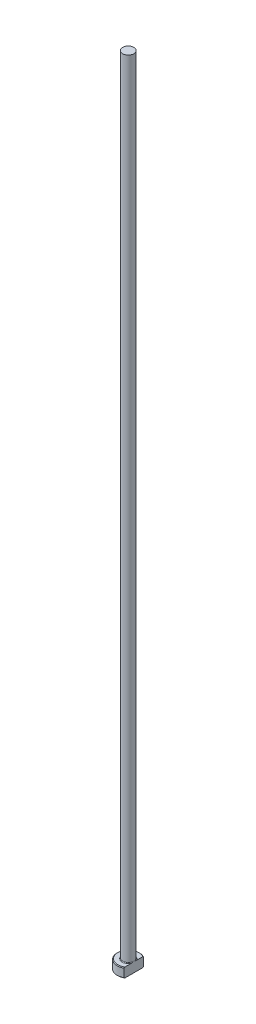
ISO-10303-21;
HEADER;
FILE_DESCRIPTION(('STEP AP214'),'2;1');
FILE_NAME('part.step','',(''),(''),'','','');
FILE_SCHEMA(('AUTOMOTIVE_DESIGN { 1 0 10303 214 1 1 1 1 }'));
ENDSEC;
DATA;
#1=APPLICATION_CONTEXT('core data for automotive mechanical design processes');
#2=APPLICATION_PROTOCOL_DEFINITION('international standard','automotive_design',2000,#1);
#3=PRODUCT_CONTEXT('',#1,'mechanical');
#4=PRODUCT('Part','Part','',(#3));
#5=PRODUCT_RELATED_PRODUCT_CATEGORY('part','',(#4));
#6=PRODUCT_DEFINITION_FORMATION('','',#4);
#7=PRODUCT_DEFINITION_CONTEXT('part definition',#1,'design');
#8=PRODUCT_DEFINITION('design','',#6,#7);
#9=PRODUCT_DEFINITION_SHAPE('','',#8);
#10=(LENGTH_UNIT() NAMED_UNIT(*) SI_UNIT(.MILLI.,.METRE.));
#11=(NAMED_UNIT(*) PLANE_ANGLE_UNIT() SI_UNIT($,.RADIAN.));
#12=(NAMED_UNIT(*) SI_UNIT($,.STERADIAN.) SOLID_ANGLE_UNIT());
#13=UNCERTAINTY_MEASURE_WITH_UNIT(LENGTH_MEASURE(1.E-05),#10,'distance_accuracy_value','');
#14=(GEOMETRIC_REPRESENTATION_CONTEXT(3) GLOBAL_UNCERTAINTY_ASSIGNED_CONTEXT((#13)) GLOBAL_UNIT_ASSIGNED_CONTEXT((#10,
#11,#12)) REPRESENTATION_CONTEXT('',''));
#15=CARTESIAN_POINT('',(0.,0.,0.));
#16=DIRECTION('',(0.,0.,1.));
#17=DIRECTION('',(1.,0.,0.));
#18=AXIS2_PLACEMENT_3D('',#15,#16,#17);
#19=CARTESIAN_POINT('',(0.,0.,0.));
#20=DIRECTION('',(0.,-1.,0.));
#21=DIRECTION('',(0.,0.,-1.));
#22=AXIS2_PLACEMENT_3D('',#19,#20,#21);
#23=PLANE('',#22);
#24=CARTESIAN_POINT('',(0.,0.,0.));
#25=DIRECTION('',(0.,-1.,0.));
#26=DIRECTION('',(0.,0.,-1.));
#27=AXIS2_PLACEMENT_3D('',#24,#25,#26);
#28=CIRCLE('',#27,3.29999999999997);
#29=CARTESIAN_POINT('',(1.74999999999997,0.,2.79776696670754));
#30=VERTEX_POINT('',#29);
#31=CARTESIAN_POINT('',(1.74999999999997,0.,-2.79776696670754));
#32=VERTEX_POINT('',#31);
#33=EDGE_CURVE('E98',#30,#32,#28,.T.);
#34=ORIENTED_EDGE('',*,*,#33,.T.);
#35=DIRECTION('',(0.,0.,1.));
#36=VECTOR('',#35,1.);
#37=CARTESIAN_POINT('',(1.74999999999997,0.,-3.03108891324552));
#38=LINE('',#37,#36);
#39=EDGE_CURVE('E83',#32,#30,#38,.T.);
#40=ORIENTED_EDGE('',*,*,#39,.T.);
#41=EDGE_LOOP('',(#34,#40));
#42=FACE_BOUND('',#41,.T.);
#43=ADVANCED_FACE('F32',(#42),#23,.T.);
#44=CARTESIAN_POINT('',(0.,259.958771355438,0.));
#45=DIRECTION('',(0.,1.,0.));
#46=DIRECTION('',(0.,0.,1.));
#47=AXIS2_PLACEMENT_3D('',#44,#45,#46);
#48=CYLINDRICAL_SURFACE('',#47,3.49999999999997);
#49=CARTESIAN_POINT('',(0.,2.79999999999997,0.));
#50=DIRECTION('',(0.,1.,0.));
#51=DIRECTION('',(0.,0.,1.));
#52=AXIS2_PLACEMENT_3D('',#49,#50,#51);
#53=CIRCLE('',#52,3.49999999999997);
#54=CARTESIAN_POINT('',(1.74999999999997,2.79999999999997,3.03108891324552));
#55=VERTEX_POINT('',#54);
#56=CARTESIAN_POINT('',(1.74999999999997,2.79999999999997,-3.03108891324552));
#57=VERTEX_POINT('',#56);
#58=EDGE_CURVE('E104',#55,#57,#53,.F.);
#59=ORIENTED_EDGE('',*,*,#58,.T.);
#60=DIRECTION('',(0.,-1.,0.));
#61=VECTOR('',#60,1.);
#62=CARTESIAN_POINT('',(1.74999999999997,250.,-3.03108891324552));
#63=LINE('',#62,#61);
#64=CARTESIAN_POINT('',(1.74999999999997,0.199999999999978,-3.03108891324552));
#65=VERTEX_POINT('',#64);
#66=EDGE_CURVE('E183',#57,#65,#63,.T.);
#67=ORIENTED_EDGE('',*,*,#66,.T.);
#68=CARTESIAN_POINT('',(0.,0.199999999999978,0.));
#69=DIRECTION('',(0.,-1.,0.));
#70=DIRECTION('',(0.,0.,-1.));
#71=AXIS2_PLACEMENT_3D('',#68,#69,#70);
#72=CIRCLE('',#71,3.49999999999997);
#73=CARTESIAN_POINT('',(1.74999999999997,0.199999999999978,3.03108891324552));
#74=VERTEX_POINT('',#73);
#75=EDGE_CURVE('E100',#65,#74,#72,.F.);
#76=ORIENTED_EDGE('',*,*,#75,.T.);
#77=DIRECTION('',(0.,-1.,0.));
#78=VECTOR('',#77,1.);
#79=CARTESIAN_POINT('',(1.74999999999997,250.,3.03108891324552));
#80=LINE('',#79,#78);
#81=EDGE_CURVE('E93',#55,#74,#80,.T.);
#82=ORIENTED_EDGE('',*,*,#81,.F.);
#83=EDGE_LOOP('',(#59,#67,#76,#82));
#84=FACE_BOUND('',#83,.T.);
#85=ADVANCED_FACE('F158',(#84),#48,.T.);
#86=CARTESIAN_POINT('',(-3.49999999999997,3.,0.));
#87=DIRECTION('',(0.,1.,0.));
#88=DIRECTION('',(0.,0.,1.));
#89=AXIS2_PLACEMENT_3D('',#86,#87,#88);
#90=PLANE('',#89);
#91=CARTESIAN_POINT('',(0.,3.,0.));
#92=DIRECTION('',(0.,1.,0.));
#93=DIRECTION('',(0.,0.,1.));
#94=AXIS2_PLACEMENT_3D('',#91,#92,#93);
#95=CIRCLE('',#94,3.29999999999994);
#96=CARTESIAN_POINT('',(1.74999999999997,3.,-2.79776696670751));
#97=VERTEX_POINT('',#96);
#98=CARTESIAN_POINT('',(1.74999999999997,3.,2.79776696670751));
#99=VERTEX_POINT('',#98);
#100=EDGE_CURVE('E178',#97,#99,#95,.T.);
#101=ORIENTED_EDGE('',*,*,#100,.T.);
#102=DIRECTION('',(0.,0.,-1.));
#103=VECTOR('',#102,1.);
#104=CARTESIAN_POINT('',(1.74999999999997,3.,0.));
#105=LINE('',#104,#103);
#106=CARTESIAN_POINT('',(1.74999999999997,2.99999999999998,0.860232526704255));
#107=VERTEX_POINT('',#106);
#108=EDGE_CURVE('E57',#99,#107,#105,.T.);
#109=ORIENTED_EDGE('',*,*,#108,.T.);
#110=CARTESIAN_POINT('',(0.,3.,0.));
#111=DIRECTION('',(0.,1.,0.));
#112=DIRECTION('',(0.,0.,1.));
#113=AXIS2_PLACEMENT_3D('',#110,#111,#112);
#114=CIRCLE('',#113,1.94999999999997);
#115=CARTESIAN_POINT('',(1.74999999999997,2.99999999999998,-0.860232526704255));
#116=VERTEX_POINT('',#115);
#117=EDGE_CURVE('E107',#107,#116,#114,.F.);
#118=ORIENTED_EDGE('',*,*,#117,.T.);
#119=EDGE_CURVE('E136',#116,#97,#105,.T.);
#120=ORIENTED_EDGE('',*,*,#119,.T.);
#121=EDGE_LOOP('',(#101,#109,#118,#120));
#122=FACE_BOUND('',#121,.T.);
#123=ADVANCED_FACE('F147',(#122),#90,.T.);
#124=CARTESIAN_POINT('',(0.,3.,0.));
#125=DIRECTION('',(0.,-1.,0.));
#126=DIRECTION('',(0.,0.,-1.));
#127=AXIS2_PLACEMENT_3D('',#124,#125,#126);
#128=CONICAL_SURFACE('',#127,3.29999999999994,0.785398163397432);
#129=ORIENTED_EDGE('',*,*,#58,.F.);
#130=CARTESIAN_POINT('',(1.74999999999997,-0.596308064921,6.67057455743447));
#131=CARTESIAN_POINT('',(1.74999999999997,-0.450097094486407,6.5194071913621));
#132=CARTESIAN_POINT('',(1.74999999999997,-0.304043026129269,6.36808756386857));
#133=CARTESIAN_POINT('',(1.74999999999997,-0.0123415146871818,6.06505321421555));
#134=CARTESIAN_POINT('',(1.74999999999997,0.133305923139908,5.91333848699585));
#135=CARTESIAN_POINT('',(1.74999999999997,0.424172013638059,5.60934946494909));
#136=CARTESIAN_POINT('',(1.74999999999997,0.569390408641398,5.45707492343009));
#137=CARTESIAN_POINT('',(1.74999999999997,0.859185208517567,5.15191761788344));
#138=CARTESIAN_POINT('',(1.74999999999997,1.00376161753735,4.99903485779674));
#139=CARTESIAN_POINT('',(1.74999999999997,1.28922437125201,4.69552747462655));
#140=CARTESIAN_POINT('',(1.74999999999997,1.43012702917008,4.54491820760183));
#141=CARTESIAN_POINT('',(1.74999999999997,1.71087777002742,4.24272028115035));
#142=CARTESIAN_POINT('',(1.74999999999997,1.85072585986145,4.09113162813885));
#143=CARTESIAN_POINT('',(1.74999999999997,2.12895853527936,3.78667524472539));
#144=CARTESIAN_POINT('',(1.74999999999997,2.26734342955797,3.63380779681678));
#145=CARTESIAN_POINT('',(1.74999999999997,2.54209958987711,3.3262768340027));
#146=CARTESIAN_POINT('',(1.74999999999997,2.6784709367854,3.1716133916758));
#147=CARTESIAN_POINT('',(1.74999999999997,2.89617282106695,2.91990258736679));
#148=CARTESIAN_POINT('',(1.74999999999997,2.97843114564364,2.82365864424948));
#149=CARTESIAN_POINT('',(1.74999999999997,3.14148360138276,2.62991861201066));
#150=CARTESIAN_POINT('',(1.74999999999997,3.22227758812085,2.53242240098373));
#151=CARTESIAN_POINT('',(1.74999999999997,3.38274452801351,2.33479038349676));
#152=CARTESIAN_POINT('',(1.74999999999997,3.46239661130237,2.23463757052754));
#153=CARTESIAN_POINT('',(1.74999999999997,3.61891495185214,2.03220225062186));
#154=CARTESIAN_POINT('',(1.74999999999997,3.69578187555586,1.92992026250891));
#155=CARTESIAN_POINT('',(1.74999999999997,3.8466965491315,1.72090511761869));
#156=CARTESIAN_POINT('',(1.74999999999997,3.92068375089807,1.61412795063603));
#157=CARTESIAN_POINT('',(1.74999999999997,4.06269616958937,1.396383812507));
#158=CARTESIAN_POINT('',(1.74999999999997,4.13071318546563,1.28541136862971));
#159=CARTESIAN_POINT('',(1.74999999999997,4.22516490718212,1.11561175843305));
#160=CARTESIAN_POINT('',(1.74999999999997,4.25522351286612,1.05881631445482));
#161=CARTESIAN_POINT('',(1.74999999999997,4.31237042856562,0.943756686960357));
#162=CARTESIAN_POINT('',(1.74999999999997,4.33945819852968,0.885492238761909));
#163=CARTESIAN_POINT('',(1.74999999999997,4.41499290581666,0.708569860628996));
#164=CARTESIAN_POINT('',(1.74999999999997,4.45796078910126,0.587356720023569));
#165=CARTESIAN_POINT('',(1.74999999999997,4.50447230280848,0.405622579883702));
#166=CARTESIAN_POINT('',(1.74999999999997,4.51680920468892,0.347327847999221));
#167=CARTESIAN_POINT('',(1.74999999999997,4.53592536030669,0.229813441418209));
#168=CARTESIAN_POINT('',(1.74999999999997,4.54270510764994,0.170593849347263));
#169=CARTESIAN_POINT('',(1.74999999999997,4.55022681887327,0.0519516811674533));
#170=CARTESIAN_POINT('',(1.74999999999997,4.55098747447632,-0.00746969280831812));
#171=CARTESIAN_POINT('',(1.74999999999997,4.54646541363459,-0.126082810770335));
#172=CARTESIAN_POINT('',(1.74999999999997,4.54118219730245,-0.185274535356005));
#173=CARTESIAN_POINT('',(1.74999999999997,4.52501178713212,-0.302357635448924));
#174=CARTESIAN_POINT('',(1.74999999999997,4.51417270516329,-0.360255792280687));
#175=CARTESIAN_POINT('',(1.74999999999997,4.48756668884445,-0.474896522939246));
#176=CARTESIAN_POINT('',(1.74999999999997,4.47179916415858,-0.531638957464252));
#177=CARTESIAN_POINT('',(1.74999999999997,4.43599695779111,-0.644103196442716));
#178=CARTESIAN_POINT('',(1.74999999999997,4.41593824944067,-0.699817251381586));
#179=CARTESIAN_POINT('',(1.74999999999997,4.37235913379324,-0.809843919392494));
#180=CARTESIAN_POINT('',(1.74999999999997,4.3488394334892,-0.864156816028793));
#181=CARTESIAN_POINT('',(1.74999999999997,4.27385837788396,-1.02562379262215));
#182=CARTESIAN_POINT('',(1.74999999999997,4.21814894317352,-1.13079943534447));
#183=CARTESIAN_POINT('',(1.74999999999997,4.0993572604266,-1.33694307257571));
#184=CARTESIAN_POINT('',(1.74999999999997,4.03626572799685,-1.43790554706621));
#185=CARTESIAN_POINT('',(1.74999999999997,3.90490246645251,-1.63694628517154));
#186=CARTESIAN_POINT('',(1.74999999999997,3.83661129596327,-1.73501160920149));
#187=CARTESIAN_POINT('',(1.74999999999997,3.69663576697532,-1.92859117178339));
#188=CARTESIAN_POINT('',(1.74999999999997,3.62495312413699,-2.02410666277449));
#189=CARTESIAN_POINT('',(1.74999999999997,3.47817312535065,-2.21448054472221));
#190=CARTESIAN_POINT('',(1.74999999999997,3.40304324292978,-2.30931373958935));
#191=CARTESIAN_POINT('',(1.74999999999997,3.25092223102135,-2.49748629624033));
#192=CARTESIAN_POINT('',(1.74999999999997,3.17393090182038,-2.59082549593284));
#193=CARTESIAN_POINT('',(1.74999999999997,3.01873588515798,-2.77610276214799));
#194=CARTESIAN_POINT('',(1.74999999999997,2.94053559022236,-2.86804367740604));
#195=CARTESIAN_POINT('',(1.74999999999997,2.78305359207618,-3.05099558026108));
#196=CARTESIAN_POINT('',(1.74999999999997,2.70377186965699,-3.14200655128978));
#197=CARTESIAN_POINT('',(1.74999999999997,2.49177755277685,-3.38307713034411));
#198=CARTESIAN_POINT('',(1.74999999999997,2.3583209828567,-3.53248201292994));
#199=CARTESIAN_POINT('',(1.74999999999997,2.08977689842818,-3.82982116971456));
#200=CARTESIAN_POINT('',(1.74999999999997,1.95468933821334,-3.9777554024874));
#201=CARTESIAN_POINT('',(1.74999999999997,1.68319766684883,-4.27266697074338));
#202=CARTESIAN_POINT('',(1.74999999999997,1.54679243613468,-4.4196432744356));
#203=CARTESIAN_POINT('',(1.74999999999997,1.27308598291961,-4.71275937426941));
#204=CARTESIAN_POINT('',(1.74999999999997,1.13578475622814,-4.85889916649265));
#205=CARTESIAN_POINT('',(1.74999999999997,0.734183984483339,-5.28435414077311));
#206=CARTESIAN_POINT('',(1.74999999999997,0.468971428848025,-5.56280727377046));
#207=CARTESIAN_POINT('',(1.74999999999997,0.0701049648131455,-5.97918348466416));
#208=CARTESIAN_POINT('',(1.74999999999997,-0.0629507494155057,-6.11768155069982));
#209=CARTESIAN_POINT('',(1.74999999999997,-0.32939522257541,-6.39435480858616));
#210=CARTESIAN_POINT('',(1.74999999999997,-0.462783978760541,-6.53253000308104));
#211=CARTESIAN_POINT('',(1.74999999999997,-0.596308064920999,-6.67057455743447));
#212=B_SPLINE_CURVE_WITH_KNOTS('',3,(#130,#131,#132,#133,#134,#135,#136,#137,#138,#139,#140,
#141,#142,#143,#144,#145,#146,#147,#148,#149,#150,#151,#152,#153,#154,#155,#156,#157,#158,#159,
#160,#161,#162,#163,#164,#165,#166,#167,#168,#169,#170,#171,#172,#173,#174,#175,#176,#177,#178,
#179,#180,#181,#182,#183,#184,#185,#186,#187,#188,#189,#190,#191,#192,#193,#194,#195,#196,#197,
#198,#199,#200,#201,#202,#203,#204,#205,#206,#207,#208,#209,#210,#211),.UNSPECIFIED.,.F.,.F.,(4,
2,2,2,2,2,2,2,2,2,2,2,2,2,2,2,2,2,2,2,2,2,2,2,2,2,2,2,2,2,2,2,2,2,2,2,2,2,2,2,4),(0.,
0.63092275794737,1.26185363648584,1.89310749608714,2.5243572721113,3.1430865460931,
3.76181177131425,4.38040374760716,4.9989708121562,5.37878108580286,5.75862861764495,
6.14249031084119,6.52625953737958,6.91585739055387,7.30598230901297,7.49867618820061,
7.69140503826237,8.07538783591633,8.25392686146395,8.43245002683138,8.610418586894,
8.7884018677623,8.96486927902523,9.14135783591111,9.31886171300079,9.49632938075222,
9.85286274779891,10.209849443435,10.5682434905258,10.9264581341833,11.2893876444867,
11.652356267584,12.0144447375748,12.3765396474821,12.9775131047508,13.5785034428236,
14.1800594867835,14.7816183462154,15.9352370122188,16.5114050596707,17.087568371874),.UNSPECIFIED.);
#213=EDGE_CURVE('E135',#55,#99,#212,.T.);
#214=ORIENTED_EDGE('',*,*,#213,.T.);
#215=ORIENTED_EDGE('',*,*,#100,.F.);
#216=EDGE_CURVE('E127',#97,#57,#212,.T.);
#217=ORIENTED_EDGE('',*,*,#216,.T.);
#218=EDGE_LOOP('',(#129,#214,#215,#217));
#219=FACE_BOUND('',#218,.T.);
#220=ADVANCED_FACE('F143',(#219),#128,.T.);
#221=CARTESIAN_POINT('',(0.,0.199999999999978,0.));
#222=DIRECTION('',(0.,1.,0.));
#223=DIRECTION('',(0.,0.,1.));
#224=AXIS2_PLACEMENT_3D('',#221,#222,#223);
#225=CONICAL_SURFACE('',#224,3.49999999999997,0.785398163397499);
#226=ORIENTED_EDGE('',*,*,#75,.F.);
#227=CARTESIAN_POINT('',(1.74999999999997,3.59630806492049,-6.67057455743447));
#228=CARTESIAN_POINT('',(1.74999999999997,3.45009709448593,-6.51940719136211));
#229=CARTESIAN_POINT('',(1.74999999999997,3.30404302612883,-6.36808756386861));
#230=CARTESIAN_POINT('',(1.74999999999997,3.01234151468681,-6.0650532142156));
#231=CARTESIAN_POINT('',(1.74999999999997,2.86669407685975,-5.91333848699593));
#232=CARTESIAN_POINT('',(1.74999999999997,2.57582798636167,-5.60934946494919));
#233=CARTESIAN_POINT('',(1.74999999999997,2.43060959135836,-5.45707492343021));
#234=CARTESIAN_POINT('',(1.74999999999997,2.14081479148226,-5.15191761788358));
#235=CARTESIAN_POINT('',(1.74999999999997,1.99623838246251,-4.9990348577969));
#236=CARTESIAN_POINT('',(1.74999999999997,1.71077562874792,-4.69552747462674));
#237=CARTESIAN_POINT('',(1.74999999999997,1.56987297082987,-4.54491820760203));
#238=CARTESIAN_POINT('',(1.74999999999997,1.28912222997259,-4.24272028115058));
#239=CARTESIAN_POINT('',(1.74999999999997,1.1492741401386,-4.0911316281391));
#240=CARTESIAN_POINT('',(1.74999999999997,0.871041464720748,-3.78667524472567));
#241=CARTESIAN_POINT('',(1.74999999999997,0.732656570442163,-3.63380779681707));
#242=CARTESIAN_POINT('',(1.74999999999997,0.457900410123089,-3.32627683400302));
#243=CARTESIAN_POINT('',(1.74999999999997,0.321529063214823,-3.17161339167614));
#244=CARTESIAN_POINT('',(1.74999999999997,0.103827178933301,-2.91990258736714));
#245=CARTESIAN_POINT('',(1.74999999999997,0.0215688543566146,-2.82365864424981));
#246=CARTESIAN_POINT('',(1.74999999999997,-0.141483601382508,-2.62991861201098));
#247=CARTESIAN_POINT('',(1.74999999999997,-0.222277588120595,-2.53242240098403));
#248=CARTESIAN_POINT('',(1.74999999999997,-0.382744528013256,-2.33479038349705));
#249=CARTESIAN_POINT('',(1.74999999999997,-0.462396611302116,-2.23463757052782));
#250=CARTESIAN_POINT('',(1.74999999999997,-0.618914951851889,-2.03220225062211));
#251=CARTESIAN_POINT('',(1.74999999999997,-0.695781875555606,-1.92992026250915));
#252=CARTESIAN_POINT('',(1.74999999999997,-0.84669654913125,-1.72090511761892));
#253=CARTESIAN_POINT('',(1.74999999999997,-0.920683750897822,-1.61412795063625));
#254=CARTESIAN_POINT('',(1.74999999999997,-1.06269616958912,-1.39638381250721));
#255=CARTESIAN_POINT('',(1.74999999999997,-1.13071318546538,-1.28541136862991));
#256=CARTESIAN_POINT('',(1.74999999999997,-1.22516490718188,-1.11561175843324));
#257=CARTESIAN_POINT('',(1.74999999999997,-1.25522351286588,-1.058816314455));
#258=CARTESIAN_POINT('',(1.74999999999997,-1.31237042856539,-0.943756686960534));
#259=CARTESIAN_POINT('',(1.74999999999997,-1.33945819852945,-0.885492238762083));
#260=CARTESIAN_POINT('',(1.74999999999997,-1.41499290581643,-0.708569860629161));
#261=CARTESIAN_POINT('',(1.74999999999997,-1.45796078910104,-0.58735672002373));
#262=CARTESIAN_POINT('',(1.74999999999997,-1.50447230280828,-0.405622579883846));
#263=CARTESIAN_POINT('',(1.74999999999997,-1.51680920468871,-0.347327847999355));
#264=CARTESIAN_POINT('',(1.74999999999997,-1.53592536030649,-0.229813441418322));
#265=CARTESIAN_POINT('',(1.74999999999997,-1.54270510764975,-0.170593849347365));
#266=CARTESIAN_POINT('',(1.74999999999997,-1.55022681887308,-0.0519516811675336));
#267=CARTESIAN_POINT('',(1.74999999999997,-1.55098747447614,0.00746969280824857));
#268=CARTESIAN_POINT('',(1.74999999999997,-1.54646541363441,0.126082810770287));
#269=CARTESIAN_POINT('',(1.74999999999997,-1.54118219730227,0.185274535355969));
#270=CARTESIAN_POINT('',(1.74999999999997,-1.52501178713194,0.30235763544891));
#271=CARTESIAN_POINT('',(1.74999999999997,-1.51417270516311,0.360255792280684));
#272=CARTESIAN_POINT('',(1.74999999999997,-1.48756668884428,0.474896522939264));
#273=CARTESIAN_POINT('',(1.74999999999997,-1.4717991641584,0.531638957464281));
#274=CARTESIAN_POINT('',(1.74999999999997,-1.43599695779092,0.644103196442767));
#275=CARTESIAN_POINT('',(1.74999999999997,-1.41593824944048,0.699817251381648));
#276=CARTESIAN_POINT('',(1.74999999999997,-1.37235913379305,0.809843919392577));
#277=CARTESIAN_POINT('',(1.74999999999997,-1.348839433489,0.864156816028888));
#278=CARTESIAN_POINT('',(1.74999999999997,-1.27385837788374,1.0256237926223));
#279=CARTESIAN_POINT('',(1.74999999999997,-1.21814894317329,1.13079943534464));
#280=CARTESIAN_POINT('',(1.74999999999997,-1.09935726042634,1.33694307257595));
#281=CARTESIAN_POINT('',(1.74999999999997,-1.03626572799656,1.43790554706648));
#282=CARTESIAN_POINT('',(1.74999999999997,-0.904902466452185,1.63694628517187));
#283=CARTESIAN_POINT('',(1.74999999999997,-0.836611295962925,1.73501160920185));
#284=CARTESIAN_POINT('',(1.74999999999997,-0.696635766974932,1.92859117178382));
#285=CARTESIAN_POINT('',(1.74999999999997,-0.624953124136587,2.02410666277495));
#286=CARTESIAN_POINT('',(1.74999999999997,-0.478173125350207,2.21448054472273));
#287=CARTESIAN_POINT('',(1.74999999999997,-0.403043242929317,2.3093137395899));
#288=CARTESIAN_POINT('',(1.74999999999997,-0.250922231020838,2.49748629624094));
#289=CARTESIAN_POINT('',(1.74999999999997,-0.173930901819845,2.59082549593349));
#290=CARTESIAN_POINT('',(1.74999999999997,-0.0187358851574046,2.7761027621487));
#291=CARTESIAN_POINT('',(1.74999999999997,0.0594644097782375,2.86804367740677));
#292=CARTESIAN_POINT('',(1.74999999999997,0.216946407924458,3.05099558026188));
#293=CARTESIAN_POINT('',(1.74999999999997,0.296228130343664,3.14200655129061));
#294=CARTESIAN_POINT('',(1.74999999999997,0.508222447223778,3.38307713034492));
#295=CARTESIAN_POINT('',(1.74999999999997,0.641679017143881,3.53248201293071));
#296=CARTESIAN_POINT('',(1.74999999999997,0.910223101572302,3.82982116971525));
#297=CARTESIAN_POINT('',(1.74999999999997,1.04531066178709,3.97775540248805));
#298=CARTESIAN_POINT('',(1.74999999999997,1.3168023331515,4.27266697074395));
#299=CARTESIAN_POINT('',(1.74999999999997,1.45320756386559,4.41964327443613));
#300=CARTESIAN_POINT('',(1.74999999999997,1.72691401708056,4.71275937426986));
#301=CARTESIAN_POINT('',(1.74999999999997,1.86421524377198,4.85889916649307));
#302=CARTESIAN_POINT('',(1.74999999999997,2.26581601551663,5.28435414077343));
#303=CARTESIAN_POINT('',(1.74999999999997,2.53102857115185,5.56280727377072));
#304=CARTESIAN_POINT('',(1.74999999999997,2.92989503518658,5.97918348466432));
#305=CARTESIAN_POINT('',(1.74999999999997,3.06295074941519,6.11768155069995));
#306=CARTESIAN_POINT('',(1.74999999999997,3.329395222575,6.39435480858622));
#307=CARTESIAN_POINT('',(1.74999999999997,3.46278397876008,6.53253000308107));
#308=CARTESIAN_POINT('',(1.74999999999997,3.59630806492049,6.67057455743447));
#309=B_SPLINE_CURVE_WITH_KNOTS('',3,(#227,#228,#229,#230,#231,#232,#233,#234,#235,#236,#237,
#238,#239,#240,#241,#242,#243,#244,#245,#246,#247,#248,#249,#250,#251,#252,#253,#254,#255,#256,
#257,#258,#259,#260,#261,#262,#263,#264,#265,#266,#267,#268,#269,#270,#271,#272,#273,#274,#275,
#276,#277,#278,#279,#280,#281,#282,#283,#284,#285,#286,#287,#288,#289,#290,#291,#292,#293,#294,
#295,#296,#297,#298,#299,#300,#301,#302,#303,#304,#305,#306,#307,#308),.UNSPECIFIED.,.F.,.F.,(4,
2,2,2,2,2,2,2,2,2,2,2,2,2,2,2,2,2,2,2,2,2,2,2,2,2,2,2,2,2,2,2,2,2,2,2,2,2,2,2,4),(0.,
0.630922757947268,1.26185363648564,1.89310749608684,2.52435727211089,3.1430865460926,
3.76181177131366,4.38040374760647,4.99897081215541,5.37878108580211,5.75862861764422,
6.14249031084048,6.52625953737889,6.9158573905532,7.30598230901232,7.49867618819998,
7.69140503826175,8.07538783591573,8.25392686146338,8.43245002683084,8.6104185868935,
8.78840186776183,8.9648692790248,9.14135783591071,9.31886171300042,9.49632938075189,
9.85286274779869,10.2098494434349,10.5682434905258,10.9264581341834,11.2893876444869,
11.6523562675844,12.0144447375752,12.3765396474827,12.9775131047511,13.5785034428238,
14.1800594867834,14.7816183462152,15.9352370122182,16.51140505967,17.0875683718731),.UNSPECIFIED.);
#310=EDGE_CURVE('E86',#65,#32,#309,.T.);
#311=ORIENTED_EDGE('',*,*,#310,.T.);
#312=ORIENTED_EDGE('',*,*,#33,.F.);
#313=EDGE_CURVE('E89',#30,#74,#309,.T.);
#314=ORIENTED_EDGE('',*,*,#313,.T.);
#315=EDGE_LOOP('',(#226,#311,#312,#314));
#316=FACE_BOUND('',#315,.T.);
#317=ADVANCED_FACE('F97',(#316),#225,.T.);
#318=CARTESIAN_POINT('',(0.,3.19999999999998,0.));
#319=DIRECTION('',(0.,1.,0.));
#320=DIRECTION('',(0.,0.,1.));
#321=AXIS2_PLACEMENT_3D('',#318,#319,#320);
#322=TOROIDAL_SURFACE('',#321,1.94999999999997,0.2);
#323=CARTESIAN_POINT('',(1.74999999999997,3.19999999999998,0.));
#324=CARTESIAN_POINT('',(1.74999999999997,3.20000050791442,9.38679694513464E-11));
#325=CARTESIAN_POINT('',(1.74999999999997,3.20000101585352,-1.34501098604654E-07));
#326=CARTESIAN_POINT('',(1.74999999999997,3.20000198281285,-5.41283468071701E-07));
#327=CARTESIAN_POINT('',(1.74999999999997,3.20000243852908,-8.19487700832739E-07));
#328=CARTESIAN_POINT('',(1.74999999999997,3.20000335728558,-1.4843911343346E-06));
#329=CARTESIAN_POINT('',(1.74999999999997,3.20000381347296,-1.88052630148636E-06));
#330=CARTESIAN_POINT('',(1.74999999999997,3.20000466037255,-2.72280863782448E-06));
#331=CARTESIAN_POINT('',(1.74999999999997,3.20000505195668,-3.16812551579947E-06));
#332=CARTESIAN_POINT('',(1.74999999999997,3.20000641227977,-4.80772278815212E-06));
#333=CARTESIAN_POINT('',(1.74999999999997,3.20000730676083,-6.06508167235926E-06));
#334=CARTESIAN_POINT('',(1.74999999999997,3.20000885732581,-8.62364306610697E-06));
#335=CARTESIAN_POINT('',(1.74999999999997,3.20000952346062,-9.91907764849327E-06));
#336=CARTESIAN_POINT('',(1.74999999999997,3.20001212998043,-1.51310765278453E-05));
#337=CARTESIAN_POINT('',(1.74999999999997,3.20001395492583,-1.91092654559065E-05));
#338=CARTESIAN_POINT('',(1.74999999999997,3.2000168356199,-2.68327805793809E-05));
#339=CARTESIAN_POINT('',(1.74999999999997,3.20001795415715,-3.05551299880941E-05));
#340=CARTESIAN_POINT('',(1.74999999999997,3.20002287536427,-4.68261372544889E-05));
#341=CARTESIAN_POINT('',(1.74999999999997,3.20002674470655,-5.93446276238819E-05));
#342=CARTESIAN_POINT('',(1.74999999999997,3.20003278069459,-8.25255939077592E-05));
#343=CARTESIAN_POINT('',(1.74999999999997,3.20003512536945,-9.31393220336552E-05));
#344=CARTESIAN_POINT('',(1.74999999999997,3.20005413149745,-0.00017197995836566));
#345=CARTESIAN_POINT('',(1.74999999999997,3.20007897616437,-0.000237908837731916));
#346=CARTESIAN_POINT('',(1.74999999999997,3.20017305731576,-0.000496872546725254));
#347=CARTESIAN_POINT('',(1.74999999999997,3.20023617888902,-0.00069150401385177));
#348=CARTESIAN_POINT('',(1.74999999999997,3.20048774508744,-0.00145613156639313));
#349=CARTESIAN_POINT('',(1.74999999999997,3.20068259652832,-0.00202450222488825));
#350=CARTESIAN_POINT('',(1.74999999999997,3.20148279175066,-0.0043694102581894));
#351=CARTESIAN_POINT('',(1.74999999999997,3.20208089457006,-0.00614773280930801));
#352=CARTESIAN_POINT('',(1.74999999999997,3.20853845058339,-0.0253339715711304));
#353=CARTESIAN_POINT('',(1.74999999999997,3.21443574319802,-0.0427328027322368));
#354=CARTESIAN_POINT('',(1.74999999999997,3.22594434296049,-0.0768841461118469));
#355=CARTESIAN_POINT('',(1.74999999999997,3.2315579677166,-0.0936359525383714));
#356=CARTESIAN_POINT('',(1.74999999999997,3.24339960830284,-0.129193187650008));
#357=CARTESIAN_POINT('',(1.74999999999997,3.24961959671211,-0.148001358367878));
#358=CARTESIAN_POINT('',(1.74999999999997,3.26199268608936,-0.185858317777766));
#359=CARTESIAN_POINT('',(1.74999999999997,3.26814439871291,-0.204907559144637));
#360=CARTESIAN_POINT('',(1.74999999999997,3.28302129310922,-0.251728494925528));
#361=CARTESIAN_POINT('',(1.74999999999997,3.29164632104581,-0.279532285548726));
#362=CARTESIAN_POINT('',(1.74999999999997,3.30815507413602,-0.334622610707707));
#363=CARTESIAN_POINT('',(1.74999999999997,3.31605173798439,-0.361905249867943));
#364=CARTESIAN_POINT('',(1.74999999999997,3.33270110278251,-0.422187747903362));
#365=CARTESIAN_POINT('',(1.74999999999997,3.34130455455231,-0.4552293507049));
#366=CARTESIAN_POINT('',(1.74999999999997,3.35728256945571,-0.521873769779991));
#367=CARTESIAN_POINT('',(1.74999999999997,3.36464748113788,-0.555478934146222));
#368=CARTESIAN_POINT('',(1.74999999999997,3.37810121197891,-0.62522543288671));
#369=CARTESIAN_POINT('',(1.74999999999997,3.38407559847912,-0.661389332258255));
#370=CARTESIAN_POINT('',(1.74999999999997,3.39348021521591,-0.733973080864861));
#371=CARTESIAN_POINT('',(1.74999999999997,3.39691695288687,-0.770392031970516));
#372=CARTESIAN_POINT('',(1.74999999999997,3.39990626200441,-0.832262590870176));
#373=CARTESIAN_POINT('',(1.74999999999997,3.40032395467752,-0.85767040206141));
#374=CARTESIAN_POINT('',(1.74999999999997,3.39916217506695,-0.908260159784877));
#375=CARTESIAN_POINT('',(1.74999999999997,3.39759783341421,-0.933442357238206));
#376=CARTESIAN_POINT('',(1.74999999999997,3.39129859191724,-0.989903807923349));
#377=CARTESIAN_POINT('',(1.74999999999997,3.38586007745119,-1.02110925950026));
#378=CARTESIAN_POINT('',(1.74999999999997,3.36964168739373,-1.08216800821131));
#379=CARTESIAN_POINT('',(1.74999999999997,3.35888918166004,-1.11202738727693));
#380=CARTESIAN_POINT('',(1.74999999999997,3.33961802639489,-1.14878048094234));
#381=CARTESIAN_POINT('',(1.74999999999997,3.33455492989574,-1.15748014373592));
#382=CARTESIAN_POINT('',(1.74999999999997,3.32351587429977,-1.1742966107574));
#383=CARTESIAN_POINT('',(1.74999999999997,3.31753946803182,-1.18241312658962));
#384=CARTESIAN_POINT('',(1.74999999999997,3.30451428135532,-1.19787793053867));
#385=CARTESIAN_POINT('',(1.74999999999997,3.29745609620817,-1.20521842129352));
#386=CARTESIAN_POINT('',(1.74999999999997,3.2822352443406,-1.21865698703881));
#387=CARTESIAN_POINT('',(1.74999999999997,3.27407476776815,-1.22475746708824));
#388=CARTESIAN_POINT('',(1.74999999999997,3.25920166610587,-1.23370537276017));
#389=CARTESIAN_POINT('',(1.74999999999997,3.25274944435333,-1.23698363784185));
#390=CARTESIAN_POINT('',(1.74999999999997,3.23939659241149,-1.24245066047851));
#391=CARTESIAN_POINT('',(1.74999999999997,3.23249637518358,-1.2446404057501));
#392=CARTESIAN_POINT('',(1.74999999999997,3.21836445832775,-1.24776583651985));
#393=CARTESIAN_POINT('',(1.74999999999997,3.21113087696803,-1.24869317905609));
#394=CARTESIAN_POINT('',(1.74999999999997,3.19661788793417,-1.24917680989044));
#395=CARTESIAN_POINT('',(1.74999999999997,3.18933848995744,-1.2487333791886));
#396=CARTESIAN_POINT('',(1.74999999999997,3.17564813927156,-1.2466228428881));
#397=CARTESIAN_POINT('',(1.74999999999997,3.16921873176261,-1.24507159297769));
#398=CARTESIAN_POINT('',(1.74999999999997,3.1566813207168,-1.24099086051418));
#399=CARTESIAN_POINT('',(1.74999999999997,3.15057343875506,-1.23846101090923));
#400=CARTESIAN_POINT('',(1.74999999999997,3.13656990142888,-1.23147130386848));
#401=CARTESIAN_POINT('',(1.74999999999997,3.1288582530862,-1.2266435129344));
#402=CARTESIAN_POINT('',(1.74999999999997,3.11430996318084,-1.21581214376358));
#403=CARTESIAN_POINT('',(1.74999999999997,3.10747539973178,-1.20980585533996));
#404=CARTESIAN_POINT('',(1.74999999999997,3.09141283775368,-1.19367262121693));
#405=CARTESIAN_POINT('',(1.74999999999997,3.0827335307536,-1.18300273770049));
#406=CARTESIAN_POINT('',(1.74999999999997,3.06710756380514,-1.16049397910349));
#407=CARTESIAN_POINT('',(1.74999999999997,3.06016260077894,-1.14865397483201));
#408=CARTESIAN_POINT('',(1.74999999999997,3.04314403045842,-1.11526045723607));
#409=CARTESIAN_POINT('',(1.74999999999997,3.03452872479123,-1.09297031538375));
#410=CARTESIAN_POINT('',(1.74999999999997,3.0205187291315,-1.04724849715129));
#411=CARTESIAN_POINT('',(1.74999999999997,3.01515578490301,-1.02380790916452));
#412=CARTESIAN_POINT('',(1.74999999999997,3.00698483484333,-0.976403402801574));
#413=CARTESIAN_POINT('',(1.74999999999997,3.00418732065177,-0.952437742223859));
#414=CARTESIAN_POINT('',(1.74999999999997,3.00064912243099,-0.9043219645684));
#415=CARTESIAN_POINT('',(1.74999999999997,2.99991269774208,-0.880171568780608));
#416=CARTESIAN_POINT('',(1.74999999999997,3.00019275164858,-0.809643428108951));
#417=CARTESIAN_POINT('',(1.74999999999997,3.00344813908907,-0.763278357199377));
#418=CARTESIAN_POINT('',(1.74999999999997,3.01492484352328,-0.664825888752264));
#419=CARTESIAN_POINT('',(1.74999999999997,3.02376250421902,-0.612819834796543));
#420=CARTESIAN_POINT('',(1.74999999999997,3.04538488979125,-0.508370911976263));
#421=CARTESIAN_POINT('',(1.74999999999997,3.0582587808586,-0.455947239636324));
#422=CARTESIAN_POINT('',(1.74999999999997,3.08196429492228,-0.368604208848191));
#423=CARTESIAN_POINT('',(1.74999999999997,3.09211504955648,-0.333493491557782));
#424=CARTESIAN_POINT('',(1.74999999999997,3.11312724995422,-0.263893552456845));
#425=CARTESIAN_POINT('',(1.74999999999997,3.12397997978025,-0.229401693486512));
#426=CARTESIAN_POINT('',(1.74999999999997,3.1449667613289,-0.164340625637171));
#427=CARTESIAN_POINT('',(1.74999999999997,3.15504975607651,-0.133754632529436));
#428=CARTESIAN_POINT('',(1.74999999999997,3.17587821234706,-0.071424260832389));
#429=CARTESIAN_POINT('',(1.74999999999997,3.18663395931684,-0.0396831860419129));
#430=CARTESIAN_POINT('',(1.74999999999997,3.19791979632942,-0.0061453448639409));
#431=CARTESIAN_POINT('',(1.74999999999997,3.1985187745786,-0.00436467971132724));
#432=CARTESIAN_POINT('',(1.74999999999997,3.19931918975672,-0.00201922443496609));
#433=CARTESIAN_POINT('',(1.74999999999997,3.1995134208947,-0.00145265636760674));
#434=CARTESIAN_POINT('',(1.74999999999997,3.19976423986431,-0.000690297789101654));
#435=CARTESIAN_POINT('',(1.74999999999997,3.19982721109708,-0.000496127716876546));
#436=CARTESIAN_POINT('',(1.74999999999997,3.19992109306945,-0.000237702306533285));
#437=CARTESIAN_POINT('',(1.74999999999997,3.19994590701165,-0.000171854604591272));
#438=CARTESIAN_POINT('',(1.74999999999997,3.19996489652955,-9.31045536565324E-05));
#439=CARTESIAN_POINT('',(1.74999999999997,3.19996724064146,-8.24963335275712E-05));
#440=CARTESIAN_POINT('',(1.74999999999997,3.19997327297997,-5.93277760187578E-05));
#441=CARTESIAN_POINT('',(1.74999999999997,3.1999771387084,-4.68160427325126E-05));
#442=CARTESIAN_POINT('',(1.74999999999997,3.19998205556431,-3.05525841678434E-05));
#443=CARTESIAN_POINT('',(1.74999999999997,3.19998317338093,-2.68310310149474E-05));
#444=CARTESIAN_POINT('',(1.74999999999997,3.19998605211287,-1.91090650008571E-05));
#445=CARTESIAN_POINT('',(1.74999999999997,3.19998787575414,-1.51315953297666E-05));
#446=CARTESIAN_POINT('',(1.74999999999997,3.19999048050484,-9.92029969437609E-06));
#447=CARTESIAN_POINT('',(1.74999999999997,3.19999114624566,-8.62492588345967E-06));
#448=CARTESIAN_POINT('',(1.74999999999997,3.19999269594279,-6.06641152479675E-06));
#449=CARTESIAN_POINT('',(1.74999999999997,3.19999358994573,-4.80903333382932E-06));
#450=CARTESIAN_POINT('',(1.74999999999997,3.19999494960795,-3.16932189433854E-06));
#451=CARTESIAN_POINT('',(1.74999999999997,3.19999534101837,-2.72395382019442E-06));
#452=CARTESIAN_POINT('',(1.74999999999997,3.19999618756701,-1.88153780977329E-06));
#453=CARTESIAN_POINT('',(1.74999999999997,3.19999664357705,-1.48531958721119E-06));
#454=CARTESIAN_POINT('',(1.74999999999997,3.1999975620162,-8.20216861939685E-07));
#455=CARTESIAN_POINT('',(1.74999999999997,3.19999801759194,-5.41901808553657E-07));
#456=CARTESIAN_POINT('',(1.74999999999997,3.19999898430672,-1.34847126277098E-07));
#457=CARTESIAN_POINT('',(1.74999999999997,3.19999949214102,-9.38577158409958E-11));
#458=CARTESIAN_POINT('',(1.74999999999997,3.19999999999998,0.));
#459=B_SPLINE_CURVE_WITH_KNOTS('',3,(#323,#324,#325,#326,#327,#328,#329,#330,#331,#332,#333,
#334,#335,#336,#337,#338,#339,#340,#341,#342,#343,#344,#345,#346,#347,#348,#349,#350,#351,#352,
#353,#354,#355,#356,#357,#358,#359,#360,#361,#362,#363,#364,#365,#366,#367,#368,#369,#370,#371,
#372,#373,#374,#375,#376,#377,#378,#379,#380,#381,#382,#383,#384,#385,#386,#387,#388,#389,#390,
#391,#392,#393,#394,#395,#396,#397,#398,#399,#400,#401,#402,#403,#404,#405,#406,#407,#408,#409,
#410,#411,#412,#413,#414,#415,#416,#417,#418,#419,#420,#421,#422,#423,#424,#425,#426,#427,#428,
#429,#430,#431,#432,#433,#434,#435,#436,#437,#438,#439,#440,#441,#442,#443,#444,#445,#446,#447,
#448,#449,#450,#451,#452,#453,#454,#455,#456,#457,#458),.UNSPECIFIED.,.T.,.F.,(4,2,2,2,2,2,2,2,
2,2,2,2,2,2,2,2,2,2,2,2,2,2,2,2,2,2,2,2,2,2,2,2,2,2,2,2,2,2,2,2,2,2,2,2,2,2,2,2,2,2,2,2,2,2,2,2,
2,2,2,2,2,2,2,2,2,2,2,4),(0.,1.52538207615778E-06,3.12059533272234E-06,4.92466458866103E-06,
6.70193593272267E-06,1.13103009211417E-05,1.56767125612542E-05,2.8774065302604E-05,
4.0421459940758E-05,7.97265134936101E-05,0.00011230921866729,0.000323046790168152,
0.000937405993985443,0.0027392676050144,0.00836862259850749,0.0634773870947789,
0.116480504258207,0.175909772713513,0.235963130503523,0.32329152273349,0.408492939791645,
0.510903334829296,0.614078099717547,0.723976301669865,0.833591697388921,0.909765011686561,
0.985360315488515,1.08013194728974,1.1744204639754,1.20457287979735,1.23474010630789,
1.26518627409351,1.29557281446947,1.3172031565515,1.33881383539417,1.36056665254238,
1.38231501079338,1.40207044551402,1.42183329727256,1.44897527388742,1.47618041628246,
1.51721056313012,1.55828069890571,1.62957223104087,1.70154887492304,1.77381858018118,
1.84623752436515,1.98535010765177,2.1434225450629,2.30526751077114,2.41490365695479,
2.52337268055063,2.61998889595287,2.72052170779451,2.72615854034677,2.72795468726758,
2.72856758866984,2.72877806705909,2.72881063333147,2.72884991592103,2.7288615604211,
2.72887465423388,2.72887901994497,2.72888362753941,2.72888540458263,2.72888720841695,
2.72888880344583,2.72889032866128),.UNSPECIFIED.);
#460=CARTESIAN_POINT('',(1.74999999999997,3.19999999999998,0.));
#461=VERTEX_POINT('',#460);
#462=EDGE_CURVE('E11',#116,#461,#459,.T.);
#463=ORIENTED_EDGE('',*,*,#462,.F.);
#464=ORIENTED_EDGE('',*,*,#117,.F.);
#465=CARTESIAN_POINT('',(1.74999999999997,3.19999999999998,0.));
#466=CARTESIAN_POINT('',(1.74999999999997,3.19999949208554,-9.38679203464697E-11));
#467=CARTESIAN_POINT('',(1.74999999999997,3.19999898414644,1.34501098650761E-07));
#468=CARTESIAN_POINT('',(1.74999999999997,3.19999801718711,5.41283468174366E-07));
#469=CARTESIAN_POINT('',(1.74999999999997,3.19999756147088,8.1948770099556E-07));
#470=CARTESIAN_POINT('',(1.74999999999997,3.19999664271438,1.48439113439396E-06));
#471=CARTESIAN_POINT('',(1.74999999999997,3.19999618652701,1.88052630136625E-06));
#472=CARTESIAN_POINT('',(1.74999999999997,3.19999533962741,2.72280863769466E-06));
#473=CARTESIAN_POINT('',(1.74999999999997,3.19999494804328,3.16812551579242E-06));
#474=CARTESIAN_POINT('',(1.74999999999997,3.1999935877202,4.80772278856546E-06));
#475=CARTESIAN_POINT('',(1.74999999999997,3.19999269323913,6.06508167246E-06));
#476=CARTESIAN_POINT('',(1.74999999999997,3.19999114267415,8.62364306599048E-06));
#477=CARTESIAN_POINT('',(1.74999999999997,3.19999047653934,9.91907764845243E-06));
#478=CARTESIAN_POINT('',(1.74999999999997,3.19998787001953,1.51310765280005E-05));
#479=CARTESIAN_POINT('',(1.74999999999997,3.19998604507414,1.91092654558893E-05));
#480=CARTESIAN_POINT('',(1.74999999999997,3.19998316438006,2.68327805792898E-05));
#481=CARTESIAN_POINT('',(1.74999999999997,3.19998204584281,3.05551299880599E-05));
#482=CARTESIAN_POINT('',(1.74999999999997,3.19997712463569,4.68261372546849E-05));
#483=CARTESIAN_POINT('',(1.74999999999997,3.19997325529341,5.93446276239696E-05));
#484=CARTESIAN_POINT('',(1.74999999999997,3.19996721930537,8.25255939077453E-05));
#485=CARTESIAN_POINT('',(1.74999999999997,3.19996487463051,9.3139322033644E-05));
#486=CARTESIAN_POINT('',(1.74999999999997,3.19994586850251,0.000171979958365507));
#487=CARTESIAN_POINT('',(1.74999999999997,3.19992102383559,0.000237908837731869));
#488=CARTESIAN_POINT('',(1.74999999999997,3.1998269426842,0.000496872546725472));
#489=CARTESIAN_POINT('',(1.74999999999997,3.19976382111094,0.000691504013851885));
#490=CARTESIAN_POINT('',(1.74999999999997,3.19951225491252,0.00145613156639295));
#491=CARTESIAN_POINT('',(1.74999999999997,3.19931740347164,0.00202450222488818));
#492=CARTESIAN_POINT('',(1.74999999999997,3.1985172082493,0.00436941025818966));
#493=CARTESIAN_POINT('',(1.74999999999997,3.1979191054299,0.00614773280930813));
#494=CARTESIAN_POINT('',(1.74999999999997,3.19146154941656,0.0253339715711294));
#495=CARTESIAN_POINT('',(1.74999999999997,3.18556425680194,0.0427328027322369));
#496=CARTESIAN_POINT('',(1.74999999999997,3.17405565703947,0.0768841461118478));
#497=CARTESIAN_POINT('',(1.74999999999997,3.16844203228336,0.0936359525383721));
#498=CARTESIAN_POINT('',(1.74999999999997,3.15660039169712,0.129193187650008));
#499=CARTESIAN_POINT('',(1.74999999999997,3.15038040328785,0.148001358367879));
#500=CARTESIAN_POINT('',(1.74999999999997,3.1380073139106,0.185858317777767));
#501=CARTESIAN_POINT('',(1.74999999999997,3.13185560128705,0.204907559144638));
#502=CARTESIAN_POINT('',(1.74999999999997,3.11697870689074,0.251728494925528));
#503=CARTESIAN_POINT('',(1.74999999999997,3.10835367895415,0.279532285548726));
#504=CARTESIAN_POINT('',(1.74999999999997,3.09184492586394,0.334622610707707));
#505=CARTESIAN_POINT('',(1.74999999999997,3.08394826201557,0.361905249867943));
#506=CARTESIAN_POINT('',(1.74999999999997,3.06729889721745,0.422187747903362));
#507=CARTESIAN_POINT('',(1.74999999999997,3.05869544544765,0.4552293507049));
#508=CARTESIAN_POINT('',(1.74999999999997,3.04271743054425,0.521873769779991));
#509=CARTESIAN_POINT('',(1.74999999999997,3.03535251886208,0.555478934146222));
#510=CARTESIAN_POINT('',(1.74999999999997,3.02189878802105,0.62522543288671));
#511=CARTESIAN_POINT('',(1.74999999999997,3.01592440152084,0.661389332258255));
#512=CARTESIAN_POINT('',(1.74999999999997,3.00651978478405,0.733973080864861));
#513=CARTESIAN_POINT('',(1.74999999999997,3.00308304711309,0.770392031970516));
#514=CARTESIAN_POINT('',(1.74999999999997,3.00009373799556,0.832262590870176));
#515=CARTESIAN_POINT('',(1.74999999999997,2.99967604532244,0.85767040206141));
#516=CARTESIAN_POINT('',(1.74999999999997,3.00083782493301,0.908260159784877));
#517=CARTESIAN_POINT('',(1.74999999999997,3.00240216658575,0.933442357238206));
#518=CARTESIAN_POINT('',(1.74999999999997,3.00870140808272,0.989903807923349));
#519=CARTESIAN_POINT('',(1.74999999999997,3.01413992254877,1.02110925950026));
#520=CARTESIAN_POINT('',(1.74999999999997,3.03035831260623,1.08216800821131));
#521=CARTESIAN_POINT('',(1.74999999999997,3.04111081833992,1.11202738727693));
#522=CARTESIAN_POINT('',(1.74999999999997,3.06038197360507,1.14878048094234));
#523=CARTESIAN_POINT('',(1.74999999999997,3.06544507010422,1.15748014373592));
#524=CARTESIAN_POINT('',(1.74999999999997,3.07648412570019,1.1742966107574));
#525=CARTESIAN_POINT('',(1.74999999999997,3.08246053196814,1.18241312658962));
#526=CARTESIAN_POINT('',(1.74999999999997,3.09548571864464,1.19787793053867));
#527=CARTESIAN_POINT('',(1.74999999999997,3.10254390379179,1.20521842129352));
#528=CARTESIAN_POINT('',(1.74999999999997,3.11776475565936,1.21865698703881));
#529=CARTESIAN_POINT('',(1.74999999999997,3.12592523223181,1.22475746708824));
#530=CARTESIAN_POINT('',(1.74999999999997,3.14079833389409,1.23370537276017));
#531=CARTESIAN_POINT('',(1.74999999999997,3.14725055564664,1.23698363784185));
#532=CARTESIAN_POINT('',(1.74999999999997,3.16060340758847,1.24245066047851));
#533=CARTESIAN_POINT('',(1.74999999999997,3.16750362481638,1.2446404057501));
#534=CARTESIAN_POINT('',(1.74999999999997,3.18163554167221,1.24776583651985));
#535=CARTESIAN_POINT('',(1.74999999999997,3.18886912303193,1.24869317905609));
#536=CARTESIAN_POINT('',(1.74999999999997,3.20338211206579,1.24917680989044));
#537=CARTESIAN_POINT('',(1.74999999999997,3.21066151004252,1.2487333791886));
#538=CARTESIAN_POINT('',(1.74999999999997,3.2243518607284,1.2466228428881));
#539=CARTESIAN_POINT('',(1.74999999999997,3.23078126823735,1.24507159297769));
#540=CARTESIAN_POINT('',(1.74999999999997,3.24331867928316,1.24099086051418));
#541=CARTESIAN_POINT('',(1.74999999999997,3.2494265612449,1.23846101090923));
#542=CARTESIAN_POINT('',(1.74999999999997,3.26343009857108,1.23147130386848));
#543=CARTESIAN_POINT('',(1.74999999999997,3.27114174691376,1.2266435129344));
#544=CARTESIAN_POINT('',(1.74999999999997,3.28569003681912,1.21581214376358));
#545=CARTESIAN_POINT('',(1.74999999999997,3.29252460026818,1.20980585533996));
#546=CARTESIAN_POINT('',(1.74999999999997,3.30858716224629,1.19367262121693));
#547=CARTESIAN_POINT('',(1.74999999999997,3.31726646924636,1.18300273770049));
#548=CARTESIAN_POINT('',(1.74999999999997,3.33289243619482,1.16049397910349));
#549=CARTESIAN_POINT('',(1.74999999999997,3.33983739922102,1.14865397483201));
#550=CARTESIAN_POINT('',(1.74999999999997,3.35685596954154,1.11526045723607));
#551=CARTESIAN_POINT('',(1.74999999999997,3.36547127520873,1.09297031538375));
#552=CARTESIAN_POINT('',(1.74999999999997,3.37948127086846,1.04724849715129));
#553=CARTESIAN_POINT('',(1.74999999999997,3.38484421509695,1.02380790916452));
#554=CARTESIAN_POINT('',(1.74999999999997,3.39301516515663,0.976403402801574));
#555=CARTESIAN_POINT('',(1.74999999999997,3.39581267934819,0.952437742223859));
#556=CARTESIAN_POINT('',(1.74999999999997,3.39935087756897,0.9043219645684));
#557=CARTESIAN_POINT('',(1.74999999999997,3.40008730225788,0.880171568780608));
#558=CARTESIAN_POINT('',(1.74999999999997,3.39980724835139,0.809643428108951));
#559=CARTESIAN_POINT('',(1.74999999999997,3.3965518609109,0.763278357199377));
#560=CARTESIAN_POINT('',(1.74999999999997,3.38507515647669,0.664825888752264));
#561=CARTESIAN_POINT('',(1.74999999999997,3.37623749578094,0.612819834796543));
#562=CARTESIAN_POINT('',(1.74999999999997,3.35461511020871,0.508370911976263));
#563=CARTESIAN_POINT('',(1.74999999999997,3.34174121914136,0.455947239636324));
#564=CARTESIAN_POINT('',(1.74999999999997,3.31803570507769,0.368604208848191));
#565=CARTESIAN_POINT('',(1.74999999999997,3.30788495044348,0.333493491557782));
#566=CARTESIAN_POINT('',(1.74999999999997,3.28687275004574,0.263893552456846));
#567=CARTESIAN_POINT('',(1.74999999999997,3.27602002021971,0.229401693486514));
#568=CARTESIAN_POINT('',(1.74999999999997,3.25503323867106,0.164340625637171));
#569=CARTESIAN_POINT('',(1.74999999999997,3.24495024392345,0.133754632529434));
#570=CARTESIAN_POINT('',(1.74999999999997,3.22412178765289,0.0714242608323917));
#571=CARTESIAN_POINT('',(1.74999999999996,3.21336604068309,0.0396831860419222));
#572=CARTESIAN_POINT('',(1.74999999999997,3.20208020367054,0.00614534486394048));
#573=CARTESIAN_POINT('',(1.74999999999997,3.20148122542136,0.00436467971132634));
#574=CARTESIAN_POINT('',(1.74999999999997,3.20068081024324,0.00201922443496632));
#575=CARTESIAN_POINT('',(1.74999999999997,3.20048657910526,0.00145265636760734));
#576=CARTESIAN_POINT('',(1.74999999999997,3.20023576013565,0.000690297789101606));
#577=CARTESIAN_POINT('',(1.74999999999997,3.20017278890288,0.000496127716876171));
#578=CARTESIAN_POINT('',(1.74999999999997,3.20007890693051,0.000237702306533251));
#579=CARTESIAN_POINT('',(1.74999999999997,3.20005409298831,0.000171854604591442));
#580=CARTESIAN_POINT('',(1.74999999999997,3.20003510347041,9.3104553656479E-05));
#581=CARTESIAN_POINT('',(1.74999999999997,3.20003275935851,8.24963335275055E-05));
#582=CARTESIAN_POINT('',(1.74999999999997,3.20002672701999,5.93277760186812E-05));
#583=CARTESIAN_POINT('',(1.74999999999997,3.20002286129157,4.68160427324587E-05));
#584=CARTESIAN_POINT('',(1.74999999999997,3.20001794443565,3.05525841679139E-05));
#585=CARTESIAN_POINT('',(1.74999999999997,3.20001682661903,2.6831031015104E-05));
#586=CARTESIAN_POINT('',(1.74999999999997,3.20001394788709,1.91090650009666E-05));
#587=CARTESIAN_POINT('',(1.74999999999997,3.20001212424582,1.51315953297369E-05));
#588=CARTESIAN_POINT('',(1.74999999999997,3.20000951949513,9.92029969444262E-06));
#589=CARTESIAN_POINT('',(1.74999999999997,3.2000088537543,8.62492588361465E-06));
#590=CARTESIAN_POINT('',(1.74999999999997,3.20000730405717,6.06641152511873E-06));
#591=CARTESIAN_POINT('',(1.74999999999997,3.20000641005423,4.80903333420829E-06));
#592=CARTESIAN_POINT('',(1.74999999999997,3.20000505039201,3.16932189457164E-06));
#593=CARTESIAN_POINT('',(1.74999999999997,3.2000046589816,2.72395382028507E-06));
#594=CARTESIAN_POINT('',(1.74999999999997,3.20000381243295,1.88153780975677E-06));
#595=CARTESIAN_POINT('',(1.74999999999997,3.20000335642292,1.48531958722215E-06));
#596=CARTESIAN_POINT('',(1.74999999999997,3.20000243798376,8.20216861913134E-07));
#597=CARTESIAN_POINT('',(1.74999999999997,3.20000198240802,5.41901808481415E-07));
#598=CARTESIAN_POINT('',(1.74999999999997,3.20000101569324,1.3484712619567E-07));
#599=CARTESIAN_POINT('',(1.74999999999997,3.20000050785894,9.38576667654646E-11));
#600=CARTESIAN_POINT('',(1.74999999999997,3.19999999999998,0.));
#601=B_SPLINE_CURVE_WITH_KNOTS('',3,(#465,#466,#467,#468,#469,#470,#471,#472,#473,#474,#475,
#476,#477,#478,#479,#480,#481,#482,#483,#484,#485,#486,#487,#488,#489,#490,#491,#492,#493,#494,
#495,#496,#497,#498,#499,#500,#501,#502,#503,#504,#505,#506,#507,#508,#509,#510,#511,#512,#513,
#514,#515,#516,#517,#518,#519,#520,#521,#522,#523,#524,#525,#526,#527,#528,#529,#530,#531,#532,
#533,#534,#535,#536,#537,#538,#539,#540,#541,#542,#543,#544,#545,#546,#547,#548,#549,#550,#551,
#552,#553,#554,#555,#556,#557,#558,#559,#560,#561,#562,#563,#564,#565,#566,#567,#568,#569,#570,
#571,#572,#573,#574,#575,#576,#577,#578,#579,#580,#581,#582,#583,#584,#585,#586,#587,#588,#589,
#590,#591,#592,#593,#594,#595,#596,#597,#598,#599,#600),.UNSPECIFIED.,.T.,.F.,(4,2,2,2,2,2,2,2,
2,2,2,2,2,2,2,2,2,2,2,2,2,2,2,2,2,2,2,2,2,2,2,2,2,2,2,2,2,2,2,2,2,2,2,2,2,2,2,2,2,2,2,2,2,2,2,2,
2,2,2,2,2,2,2,2,2,2,2,4),(0.,1.52538207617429E-06,3.12059533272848E-06,4.92466458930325E-06,
6.70193593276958E-06,1.13103009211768E-05,1.56767125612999E-05,2.87740653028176E-05,
4.04214599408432E-05,7.97265134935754E-05,0.000112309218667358,0.000323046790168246,
0.000937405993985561,0.00273926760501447,0.00836862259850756,0.0634773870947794,
0.116480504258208,0.175909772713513,0.235963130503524,0.32329152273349,0.408492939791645,
0.510903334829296,0.614078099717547,0.723976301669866,0.833591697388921,0.909765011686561,
0.985360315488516,1.08013194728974,1.1744204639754,1.20457287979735,1.23474010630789,
1.26518627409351,1.29557281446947,1.3172031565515,1.33881383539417,1.36056665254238,
1.38231501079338,1.40207044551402,1.42183329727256,1.44897527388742,1.47618041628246,
1.51721056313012,1.55828069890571,1.62957223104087,1.70154887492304,1.77381858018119,
1.84623752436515,1.98535010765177,2.1434225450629,2.30526751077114,2.41490365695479,
2.52337268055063,2.61998889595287,2.72052170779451,2.72615854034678,2.72795468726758,
2.72856758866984,2.72877806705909,2.72881063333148,2.72884991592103,2.7288615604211,
2.72887465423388,2.72887901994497,2.72888362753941,2.72888540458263,2.72888720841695,
2.72888880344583,2.72889032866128),.UNSPECIFIED.);
#602=EDGE_CURVE('E46',#461,#107,#601,.T.);
#603=ORIENTED_EDGE('',*,*,#602,.F.);
#604=CARTESIAN_POINT('',(0.,3.19999999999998,0.));
#605=DIRECTION('',(0.,1.,0.));
#606=DIRECTION('',(0.,0.,1.));
#607=AXIS2_PLACEMENT_3D('',#604,#605,#606);
#608=CIRCLE('',#607,1.74999999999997);
#609=EDGE_CURVE('E103',#461,#461,#608,.T.);
#610=ORIENTED_EDGE('',*,*,#609,.F.);
#611=EDGE_LOOP('',(#463,#464,#603,#610));
#612=FACE_BOUND('',#611,.T.);
#613=ADVANCED_FACE('F34',(#612),#322,.F.);
#614=CARTESIAN_POINT('',(0.,259.958771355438,0.));
#615=DIRECTION('',(0.,1.,0.));
#616=DIRECTION('',(0.,0.,1.));
#617=AXIS2_PLACEMENT_3D('',#614,#615,#616);
#618=CYLINDRICAL_SURFACE('',#617,1.74999999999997);
#619=ORIENTED_EDGE('',*,*,#609,.T.);
#620=EDGE_LOOP('',(#619));
#621=FACE_BOUND('',#620,.T.);
#622=CARTESIAN_POINT('',(0.,250.,0.));
#623=DIRECTION('',(0.,1.,0.));
#624=DIRECTION('',(0.,0.,1.));
#625=AXIS2_PLACEMENT_3D('',#622,#623,#624);
#626=CIRCLE('',#625,1.74999999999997);
#627=CARTESIAN_POINT('',(0.,250.,1.74999999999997));
#628=VERTEX_POINT('',#627);
#629=EDGE_CURVE('E101',#628,#628,#626,.T.);
#630=ORIENTED_EDGE('',*,*,#629,.F.);
#631=EDGE_LOOP('',(#630));
#632=FACE_BOUND('',#631,.T.);
#633=ADVANCED_FACE('F155',(#621,#632),#618,.T.);
#634=CARTESIAN_POINT('',(-1.74999999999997,250.,0.));
#635=DIRECTION('',(0.,1.,0.));
#636=DIRECTION('',(0.,0.,1.));
#637=AXIS2_PLACEMENT_3D('',#634,#635,#636);
#638=PLANE('',#637);
#639=ORIENTED_EDGE('',*,*,#629,.T.);
#640=EDGE_LOOP('',(#639));
#641=FACE_BOUND('',#640,.T.);
#642=ADVANCED_FACE('F121',(#641),#638,.T.);
#643=CARTESIAN_POINT('',(1.74999999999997,250.,-3.03108891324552));
#644=DIRECTION('',(1.,0.,0.));
#645=DIRECTION('',(0.,0.,-1.));
#646=AXIS2_PLACEMENT_3D('',#643,#644,#645);
#647=PLANE('',#646);
#648=ORIENTED_EDGE('',*,*,#66,.F.);
#649=ORIENTED_EDGE('',*,*,#216,.F.);
#650=ORIENTED_EDGE('',*,*,#119,.F.);
#651=ORIENTED_EDGE('',*,*,#462,.T.);
#652=ORIENTED_EDGE('',*,*,#602,.T.);
#653=ORIENTED_EDGE('',*,*,#108,.F.);
#654=ORIENTED_EDGE('',*,*,#213,.F.);
#655=ORIENTED_EDGE('',*,*,#81,.T.);
#656=ORIENTED_EDGE('',*,*,#313,.F.);
#657=ORIENTED_EDGE('',*,*,#39,.F.);
#658=ORIENTED_EDGE('',*,*,#310,.F.);
#659=EDGE_LOOP('',(#648,#649,#650,#651,#652,#653,#654,#655,#656,#657,#658));
#660=FACE_BOUND('',#659,.T.);
#661=ADVANCED_FACE('F85',(#660),#647,.T.);
#662=CLOSED_SHELL('',(#43,#85,#123,#220,#317,#613,#633,#642,#661));
#663=MANIFOLD_SOLID_BREP('B2',#662);
#664=ADVANCED_BREP_SHAPE_REPRESENTATION('',(#18,#663),#14);
#665=SHAPE_DEFINITION_REPRESENTATION(#9,#664);
ENDSEC;
END-ISO-10303-21;
